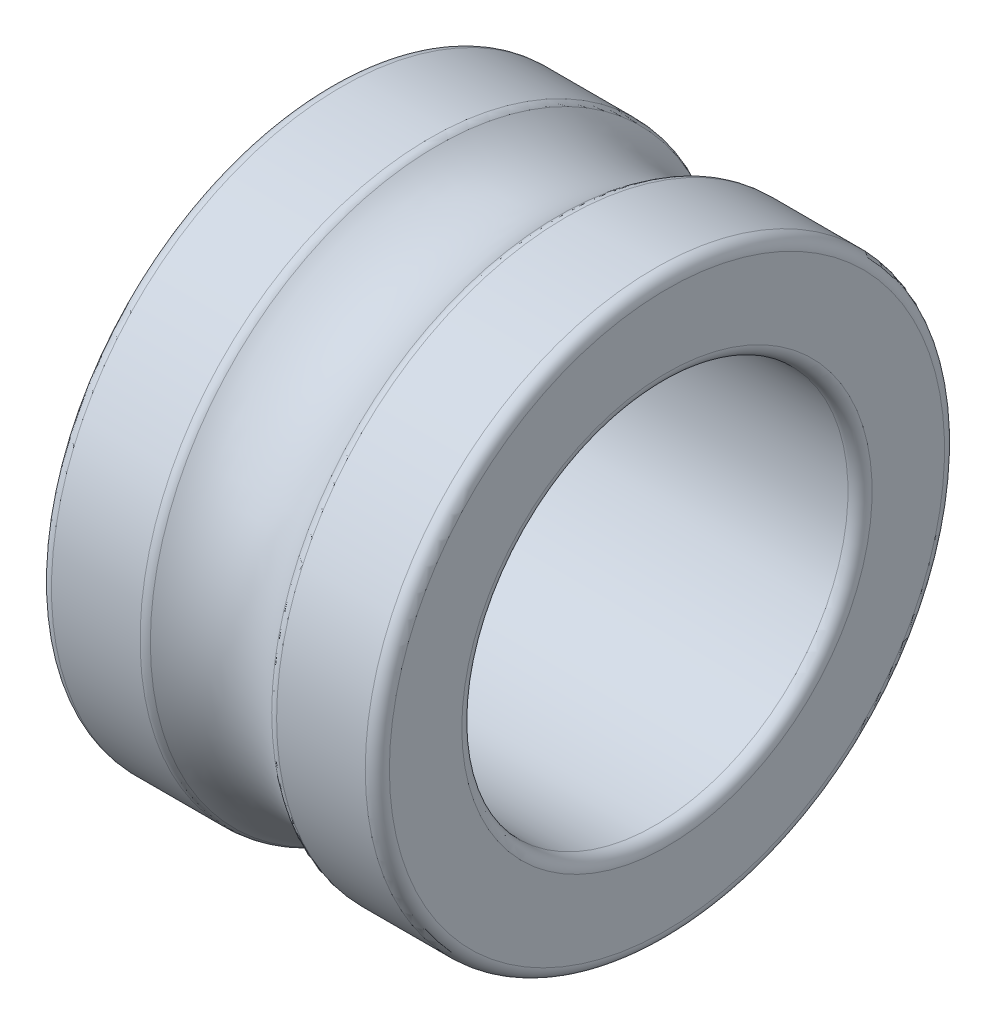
ISO-10303-21;
HEADER;
FILE_DESCRIPTION(('STEP AP214'),'2;1');
FILE_NAME('part.step','',(''),(''),'','','');
FILE_SCHEMA(('AUTOMOTIVE_DESIGN { 1 0 10303 214 1 1 1 1 }'));
ENDSEC;
DATA;
#1=APPLICATION_CONTEXT('core data for automotive mechanical design processes');
#2=APPLICATION_PROTOCOL_DEFINITION('international standard','automotive_design',2000,#1);
#3=PRODUCT_CONTEXT('',#1,'mechanical');
#4=PRODUCT('Part','Part','',(#3));
#5=PRODUCT_RELATED_PRODUCT_CATEGORY('part','',(#4));
#6=PRODUCT_DEFINITION_FORMATION('','',#4);
#7=PRODUCT_DEFINITION_CONTEXT('part definition',#1,'design');
#8=PRODUCT_DEFINITION('design','',#6,#7);
#9=PRODUCT_DEFINITION_SHAPE('','',#8);
#10=(LENGTH_UNIT() NAMED_UNIT(*) SI_UNIT(.MILLI.,.METRE.));
#11=(NAMED_UNIT(*) PLANE_ANGLE_UNIT() SI_UNIT($,.RADIAN.));
#12=(NAMED_UNIT(*) SI_UNIT($,.STERADIAN.) SOLID_ANGLE_UNIT());
#13=UNCERTAINTY_MEASURE_WITH_UNIT(LENGTH_MEASURE(1.E-05),#10,'distance_accuracy_value','');
#14=(GEOMETRIC_REPRESENTATION_CONTEXT(3) GLOBAL_UNCERTAINTY_ASSIGNED_CONTEXT((#13)) GLOBAL_UNIT_ASSIGNED_CONTEXT((#10,
#11,#12)) REPRESENTATION_CONTEXT('',''));
#15=CARTESIAN_POINT('',(0.,0.,0.));
#16=DIRECTION('',(0.,0.,1.));
#17=DIRECTION('',(1.,0.,0.));
#18=AXIS2_PLACEMENT_3D('',#15,#16,#17);
#19=CARTESIAN_POINT('',(-3.5,4.,0.));
#20=DIRECTION('',(1.,0.,0.));
#21=DIRECTION('',(0.,0.,-1.));
#22=AXIS2_PLACEMENT_3D('',#19,#20,#21);
#23=PLANE('',#22);
#24=CARTESIAN_POINT('',(-3.5,0.,0.));
#25=DIRECTION('',(1.,0.,0.));
#26=DIRECTION('',(0.,0.,-1.));
#27=AXIS2_PLACEMENT_3D('',#24,#25,#26);
#28=CIRCLE('',#27,5.75);
#29=CARTESIAN_POINT('',(-3.5,0.,-5.75));
#30=VERTEX_POINT('',#29);
#31=EDGE_CURVE('E39',#30,#30,#28,.F.);
#32=ORIENTED_EDGE('',*,*,#31,.T.);
#33=EDGE_LOOP('',(#32));
#34=FACE_BOUND('',#33,.T.);
#35=CARTESIAN_POINT('',(-3.5,0.,0.));
#36=DIRECTION('',(1.,0.,0.));
#37=DIRECTION('',(0.,0.,-1.));
#38=AXIS2_PLACEMENT_3D('',#35,#36,#37);
#39=CIRCLE('',#38,4.25);
#40=CARTESIAN_POINT('',(-3.5,0.,-4.25));
#41=VERTEX_POINT('',#40);
#42=EDGE_CURVE('E43',#41,#41,#39,.T.);
#43=ORIENTED_EDGE('',*,*,#42,.T.);
#44=EDGE_LOOP('',(#43));
#45=FACE_BOUND('',#44,.T.);
#46=ADVANCED_FACE('F29',(#34,#45),#23,.F.);
#47=CARTESIAN_POINT('',(-31.6676661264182,0.,0.));
#48=DIRECTION('',(-1.,0.,0.));
#49=DIRECTION('',(0.,0.,1.));
#50=AXIS2_PLACEMENT_3D('',#47,#48,#49);
#51=CYLINDRICAL_SURFACE('',#50,4.);
#52=CARTESIAN_POINT('',(-3.25,0.,0.));
#53=DIRECTION('',(1.,0.,0.));
#54=DIRECTION('',(0.,0.,-1.));
#55=AXIS2_PLACEMENT_3D('',#52,#53,#54);
#56=CIRCLE('',#55,4.);
#57=CARTESIAN_POINT('',(-3.25,0.,-4.));
#58=VERTEX_POINT('',#57);
#59=EDGE_CURVE('E10',#58,#58,#56,.F.);
#60=ORIENTED_EDGE('',*,*,#59,.T.);
#61=EDGE_LOOP('',(#60));
#62=FACE_BOUND('',#61,.T.);
#63=CARTESIAN_POINT('',(3.25,0.,0.));
#64=DIRECTION('',(-1.,0.,0.));
#65=DIRECTION('',(0.,0.,1.));
#66=AXIS2_PLACEMENT_3D('',#63,#64,#65);
#67=CIRCLE('',#66,4.);
#68=CARTESIAN_POINT('',(3.25,0.,4.));
#69=VERTEX_POINT('',#68);
#70=EDGE_CURVE('E35',#69,#69,#67,.F.);
#71=ORIENTED_EDGE('',*,*,#70,.T.);
#72=EDGE_LOOP('',(#71));
#73=FACE_BOUND('',#72,.T.);
#74=ADVANCED_FACE('F109',(#62,#73),#51,.F.);
#75=CARTESIAN_POINT('',(3.5,4.,0.));
#76=DIRECTION('',(-1.,0.,0.));
#77=DIRECTION('',(0.,0.,1.));
#78=AXIS2_PLACEMENT_3D('',#75,#76,#77);
#79=PLANE('',#78);
#80=CARTESIAN_POINT('',(3.5,0.,0.));
#81=DIRECTION('',(-1.,0.,0.));
#82=DIRECTION('',(0.,0.,1.));
#83=AXIS2_PLACEMENT_3D('',#80,#81,#82);
#84=CIRCLE('',#83,5.75);
#85=CARTESIAN_POINT('',(3.5,0.,5.75));
#86=VERTEX_POINT('',#85);
#87=EDGE_CURVE('E60',#86,#86,#84,.F.);
#88=ORIENTED_EDGE('',*,*,#87,.T.);
#89=EDGE_LOOP('',(#88));
#90=FACE_BOUND('',#89,.T.);
#91=CARTESIAN_POINT('',(3.5,0.,0.));
#92=DIRECTION('',(-1.,0.,0.));
#93=DIRECTION('',(0.,0.,1.));
#94=AXIS2_PLACEMENT_3D('',#91,#92,#93);
#95=CIRCLE('',#94,4.25);
#96=CARTESIAN_POINT('',(3.5,0.,4.25));
#97=VERTEX_POINT('',#96);
#98=EDGE_CURVE('E63',#97,#97,#95,.T.);
#99=ORIENTED_EDGE('',*,*,#98,.T.);
#100=EDGE_LOOP('',(#99));
#101=FACE_BOUND('',#100,.T.);
#102=ADVANCED_FACE('F127',(#90,#101),#79,.F.);
#103=CARTESIAN_POINT('',(-31.6676661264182,0.,0.));
#104=DIRECTION('',(-1.,0.,0.));
#105=DIRECTION('',(0.,0.,1.));
#106=AXIS2_PLACEMENT_3D('',#103,#104,#105);
#107=CYLINDRICAL_SURFACE('',#106,6.);
#108=CARTESIAN_POINT('',(3.25,0.,0.));
#109=DIRECTION('',(-1.,0.,0.));
#110=DIRECTION('',(0.,0.,1.));
#111=AXIS2_PLACEMENT_3D('',#108,#109,#110);
#112=CIRCLE('',#111,6.);
#113=CARTESIAN_POINT('',(3.25,0.,6.));
#114=VERTEX_POINT('',#113);
#115=EDGE_CURVE('E66',#114,#114,#112,.T.);
#116=ORIENTED_EDGE('',*,*,#115,.T.);
#117=EDGE_LOOP('',(#116));
#118=FACE_BOUND('',#117,.T.);
#119=CARTESIAN_POINT('',(1.4142135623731,0.,0.));
#120=DIRECTION('',(1.,0.,0.));
#121=DIRECTION('',(0.,0.,-1.));
#122=AXIS2_PLACEMENT_3D('',#119,#120,#121);
#123=CIRCLE('',#122,6.);
#124=CARTESIAN_POINT('',(1.4142135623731,0.,-6.));
#125=VERTEX_POINT('',#124);
#126=EDGE_CURVE('E69',#125,#125,#123,.T.);
#127=ORIENTED_EDGE('',*,*,#126,.T.);
#128=EDGE_LOOP('',(#127));
#129=FACE_BOUND('',#128,.T.);
#130=ADVANCED_FACE('F73',(#118,#129),#107,.T.);
#131=CARTESIAN_POINT('',(0.,0.,0.));
#132=DIRECTION('',(-1.,0.,0.));
#133=DIRECTION('',(0.,0.,1.));
#134=AXIS2_PLACEMENT_3D('',#131,#132,#133);
#135=TOROIDAL_SURFACE('',#134,7.5,2.);
#136=CARTESIAN_POINT('',(1.25707872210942,0.,0.));
#137=DIRECTION('',(-1.,0.,0.));
#138=DIRECTION('',(0.,0.,1.));
#139=AXIS2_PLACEMENT_3D('',#136,#137,#138);
#140=CIRCLE('',#139,5.94444444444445);
#141=CARTESIAN_POINT('',(1.25707872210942,0.,5.94444444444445));
#142=VERTEX_POINT('',#141);
#143=EDGE_CURVE('E54',#142,#142,#140,.T.);
#144=ORIENTED_EDGE('',*,*,#143,.T.);
#145=EDGE_LOOP('',(#144));
#146=FACE_BOUND('',#145,.T.);
#147=CARTESIAN_POINT('',(-1.25707872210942,0.,0.));
#148=DIRECTION('',(1.,0.,0.));
#149=DIRECTION('',(0.,0.,-1.));
#150=AXIS2_PLACEMENT_3D('',#147,#148,#149);
#151=CIRCLE('',#150,5.94444444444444);
#152=CARTESIAN_POINT('',(-1.25707872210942,0.,-5.94444444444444));
#153=VERTEX_POINT('',#152);
#154=EDGE_CURVE('E57',#153,#153,#151,.T.);
#155=ORIENTED_EDGE('',*,*,#154,.T.);
#156=EDGE_LOOP('',(#155));
#157=FACE_BOUND('',#156,.T.);
#158=ADVANCED_FACE('F83',(#146,#157),#135,.F.);
#159=CARTESIAN_POINT('',(-31.6676661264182,0.,0.));
#160=DIRECTION('',(-1.,0.,0.));
#161=DIRECTION('',(0.,0.,1.));
#162=AXIS2_PLACEMENT_3D('',#159,#160,#161);
#163=CYLINDRICAL_SURFACE('',#162,6.);
#164=CARTESIAN_POINT('',(-1.41421356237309,0.,0.));
#165=DIRECTION('',(1.,0.,0.));
#166=DIRECTION('',(0.,0.,-1.));
#167=AXIS2_PLACEMENT_3D('',#164,#165,#166);
#168=CIRCLE('',#167,6.);
#169=CARTESIAN_POINT('',(-1.41421356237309,0.,-6.));
#170=VERTEX_POINT('',#169);
#171=EDGE_CURVE('E48',#170,#170,#168,.F.);
#172=ORIENTED_EDGE('',*,*,#171,.T.);
#173=EDGE_LOOP('',(#172));
#174=FACE_BOUND('',#173,.T.);
#175=CARTESIAN_POINT('',(-3.25,0.,0.));
#176=DIRECTION('',(1.,0.,0.));
#177=DIRECTION('',(0.,0.,-1.));
#178=AXIS2_PLACEMENT_3D('',#175,#176,#177);
#179=CIRCLE('',#178,6.);
#180=CARTESIAN_POINT('',(-3.25,0.,-6.));
#181=VERTEX_POINT('',#180);
#182=EDGE_CURVE('E51',#181,#181,#179,.T.);
#183=ORIENTED_EDGE('',*,*,#182,.T.);
#184=EDGE_LOOP('',(#183));
#185=FACE_BOUND('',#184,.T.);
#186=ADVANCED_FACE('F86',(#174,#185),#163,.T.);
#187=CARTESIAN_POINT('',(3.25,0.,0.));
#188=DIRECTION('',(-1.,0.,0.));
#189=DIRECTION('',(0.,0.,1.));
#190=AXIS2_PLACEMENT_3D('',#187,#188,#189);
#191=TOROIDAL_SURFACE('',#190,5.75,0.25);
#192=ORIENTED_EDGE('',*,*,#87,.F.);
#193=EDGE_LOOP('',(#192));
#194=FACE_BOUND('',#193,.T.);
#195=ORIENTED_EDGE('',*,*,#115,.F.);
#196=EDGE_LOOP('',(#195));
#197=FACE_BOUND('',#196,.T.);
#198=ADVANCED_FACE('F79',(#194,#197),#191,.T.);
#199=CARTESIAN_POINT('',(1.4142135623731,0.,0.));
#200=DIRECTION('',(1.,0.,0.));
#201=DIRECTION('',(0.,0.,-1.));
#202=AXIS2_PLACEMENT_3D('',#199,#200,#201);
#203=TOROIDAL_SURFACE('',#202,5.75,0.25);
#204=ORIENTED_EDGE('',*,*,#126,.F.);
#205=EDGE_LOOP('',(#204));
#206=FACE_BOUND('',#205,.T.);
#207=ORIENTED_EDGE('',*,*,#143,.F.);
#208=EDGE_LOOP('',(#207));
#209=FACE_BOUND('',#208,.T.);
#210=ADVANCED_FACE('F75',(#206,#209),#203,.T.);
#211=CARTESIAN_POINT('',(-1.41421356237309,0.,0.));
#212=DIRECTION('',(1.,0.,0.));
#213=DIRECTION('',(0.,0.,-1.));
#214=AXIS2_PLACEMENT_3D('',#211,#212,#213);
#215=TOROIDAL_SURFACE('',#214,5.75,0.25);
#216=ORIENTED_EDGE('',*,*,#154,.F.);
#217=EDGE_LOOP('',(#216));
#218=FACE_BOUND('',#217,.T.);
#219=ORIENTED_EDGE('',*,*,#171,.F.);
#220=EDGE_LOOP('',(#219));
#221=FACE_BOUND('',#220,.T.);
#222=ADVANCED_FACE('F78',(#218,#221),#215,.T.);
#223=CARTESIAN_POINT('',(-3.25,0.,0.));
#224=DIRECTION('',(1.,0.,0.));
#225=DIRECTION('',(0.,0.,-1.));
#226=AXIS2_PLACEMENT_3D('',#223,#224,#225);
#227=TOROIDAL_SURFACE('',#226,5.75,0.25);
#228=ORIENTED_EDGE('',*,*,#182,.F.);
#229=EDGE_LOOP('',(#228));
#230=FACE_BOUND('',#229,.T.);
#231=ORIENTED_EDGE('',*,*,#31,.F.);
#232=EDGE_LOOP('',(#231));
#233=FACE_BOUND('',#232,.T.);
#234=ADVANCED_FACE('F92',(#230,#233),#227,.T.);
#235=CARTESIAN_POINT('',(-3.25,0.,0.));
#236=DIRECTION('',(1.,0.,0.));
#237=DIRECTION('',(0.,0.,-1.));
#238=AXIS2_PLACEMENT_3D('',#235,#236,#237);
#239=TOROIDAL_SURFACE('',#238,4.25,0.25);
#240=ORIENTED_EDGE('',*,*,#42,.F.);
#241=EDGE_LOOP('',(#240));
#242=FACE_BOUND('',#241,.T.);
#243=ORIENTED_EDGE('',*,*,#59,.F.);
#244=EDGE_LOOP('',(#243));
#245=FACE_BOUND('',#244,.T.);
#246=ADVANCED_FACE('F103',(#242,#245),#239,.T.);
#247=CARTESIAN_POINT('',(3.25,0.,0.));
#248=DIRECTION('',(-1.,0.,0.));
#249=DIRECTION('',(0.,0.,1.));
#250=AXIS2_PLACEMENT_3D('',#247,#248,#249);
#251=TOROIDAL_SURFACE('',#250,4.25,0.25);
#252=ORIENTED_EDGE('',*,*,#70,.F.);
#253=EDGE_LOOP('',(#252));
#254=FACE_BOUND('',#253,.T.);
#255=ORIENTED_EDGE('',*,*,#98,.F.);
#256=EDGE_LOOP('',(#255));
#257=FACE_BOUND('',#256,.T.);
#258=ADVANCED_FACE('F114',(#254,#257),#251,.T.);
#259=CLOSED_SHELL('',(#46,#74,#102,#130,#158,#186,#198,#210,#222,#234,#246,#258));
#260=MANIFOLD_SOLID_BREP('B2',#259);
#261=ADVANCED_BREP_SHAPE_REPRESENTATION('',(#18,#260),#14);
#262=SHAPE_DEFINITION_REPRESENTATION(#9,#261);
ENDSEC;
END-ISO-10303-21;
